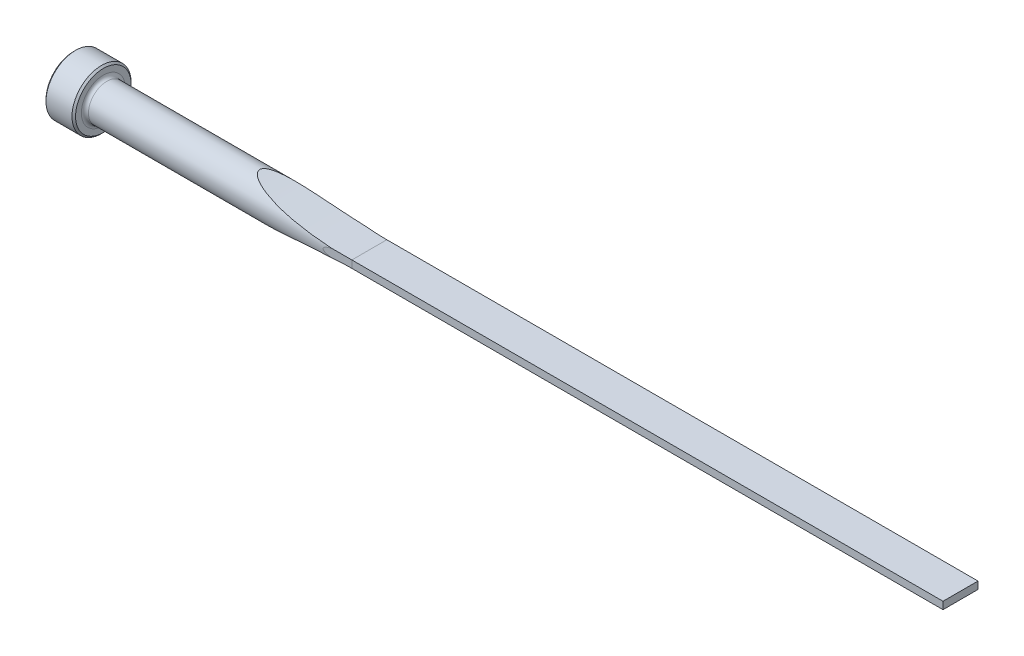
ISO-10303-21;
HEADER;
FILE_DESCRIPTION(('STEP AP214'),'2;1');
FILE_NAME('part.step','',(''),(''),'','','');
FILE_SCHEMA(('AUTOMOTIVE_DESIGN { 1 0 10303 214 1 1 1 1 }'));
ENDSEC;
DATA;
#1=APPLICATION_CONTEXT('core data for automotive mechanical design processes');
#2=APPLICATION_PROTOCOL_DEFINITION('international standard','automotive_design',2000,#1);
#3=PRODUCT_CONTEXT('',#1,'mechanical');
#4=PRODUCT('Part','Part','',(#3));
#5=PRODUCT_RELATED_PRODUCT_CATEGORY('part','',(#4));
#6=PRODUCT_DEFINITION_FORMATION('','',#4);
#7=PRODUCT_DEFINITION_CONTEXT('part definition',#1,'design');
#8=PRODUCT_DEFINITION('design','',#6,#7);
#9=PRODUCT_DEFINITION_SHAPE('','',#8);
#10=(LENGTH_UNIT() NAMED_UNIT(*) SI_UNIT(.MILLI.,.METRE.));
#11=(NAMED_UNIT(*) PLANE_ANGLE_UNIT() SI_UNIT($,.RADIAN.));
#12=(NAMED_UNIT(*) SI_UNIT($,.STERADIAN.) SOLID_ANGLE_UNIT());
#13=UNCERTAINTY_MEASURE_WITH_UNIT(LENGTH_MEASURE(1.E-05),#10,'distance_accuracy_value','');
#14=(GEOMETRIC_REPRESENTATION_CONTEXT(3) GLOBAL_UNCERTAINTY_ASSIGNED_CONTEXT((#13)) GLOBAL_UNIT_ASSIGNED_CONTEXT((#10,
#11,#12)) REPRESENTATION_CONTEXT('',''));
#15=CARTESIAN_POINT('',(0.,0.,0.));
#16=DIRECTION('',(0.,0.,1.));
#17=DIRECTION('',(1.,0.,0.));
#18=AXIS2_PLACEMENT_3D('',#15,#16,#17);
#19=CARTESIAN_POINT('',(0.,0.,0.));
#20=DIRECTION('',(-1.,0.,0.));
#21=DIRECTION('',(0.,0.,1.));
#22=AXIS2_PLACEMENT_3D('',#19,#20,#21);
#23=CYLINDRICAL_SURFACE('',#22,3.9624);
#24=CARTESIAN_POINT('',(7.112,0.,0.));
#25=DIRECTION('',(-1.,0.,0.));
#26=DIRECTION('',(0.,0.,1.));
#27=AXIS2_PLACEMENT_3D('',#24,#25,#26);
#28=CIRCLE('',#27,3.9624);
#29=CARTESIAN_POINT('',(7.112,0.,3.9624));
#30=VERTEX_POINT('',#29);
#31=EDGE_CURVE('E153',#30,#30,#28,.F.);
#32=ORIENTED_EDGE('',*,*,#31,.T.);
#33=EDGE_LOOP('',(#32));
#34=FACE_BOUND('',#33,.T.);
#35=CARTESIAN_POINT('',(63.5,1.25260892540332,3.75919999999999));
#36=CARTESIAN_POINT('',(63.2054597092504,1.25248483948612,3.75919752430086));
#37=CARTESIAN_POINT('',(62.9108915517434,1.24820563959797,3.76066368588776));
#38=CARTESIAN_POINT('',(62.3217237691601,1.23049372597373,3.76652069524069));
#39=CARTESIAN_POINT('',(62.0271244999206,1.21705045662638,3.77091491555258));
#40=CARTESIAN_POINT('',(61.4308396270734,1.17967714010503,3.78276967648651));
#41=CARTESIAN_POINT('',(61.1291720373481,1.15547987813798,3.79030802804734));
#42=CARTESIAN_POINT('',(60.5272911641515,1.09440743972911,3.80840647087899));
#43=CARTESIAN_POINT('',(60.2270772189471,1.05753871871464,3.8189650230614));
#44=CARTESIAN_POINT('',(59.7800368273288,0.989457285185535,3.83693978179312));
#45=CARTESIAN_POINT('',(59.6321720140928,0.964761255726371,3.84325719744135));
#46=CARTESIAN_POINT('',(59.3374097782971,0.910045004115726,3.85658413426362));
#47=CARTESIAN_POINT('',(59.1905125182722,0.880023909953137,3.86359376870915));
#48=CARTESIAN_POINT('',(58.8991412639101,0.813153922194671,3.87821506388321));
#49=CARTESIAN_POINT('',(58.7546584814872,0.776342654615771,3.88582328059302));
#50=CARTESIAN_POINT('',(58.4683237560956,0.692871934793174,3.90159372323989));
#51=CARTESIAN_POINT('',(58.326472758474,0.646209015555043,3.90975614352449));
#52=CARTESIAN_POINT('',(58.1184403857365,0.563595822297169,3.92220822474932));
#53=CARTESIAN_POINT('',(58.0497887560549,0.533901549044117,3.92640002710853));
#54=CARTESIAN_POINT('',(57.9154966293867,0.468472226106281,3.93475139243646));
#55=CARTESIAN_POINT('',(57.849847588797,0.432755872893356,3.93891101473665));
#56=CARTESIAN_POINT('',(57.7609652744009,0.375177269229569,3.94463417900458));
#57=CARTESIAN_POINT('',(57.7351949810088,0.357278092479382,3.94630548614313));
#58=CARTESIAN_POINT('',(57.6852094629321,0.319212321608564,3.94956785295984));
#59=CARTESIAN_POINT('',(57.6609996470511,0.299038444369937,3.95115862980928));
#60=CARTESIAN_POINT('',(57.6148081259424,0.255565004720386,3.95421108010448));
#61=CARTESIAN_POINT('',(57.5928654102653,0.232222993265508,3.95567045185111));
#62=CARTESIAN_POINT('',(57.5535366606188,0.181966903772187,3.95829832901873));
#63=CARTESIAN_POINT('',(57.5361215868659,0.155077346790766,3.95946868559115));
#64=CARTESIAN_POINT('',(57.5155791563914,0.111677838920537,3.96085301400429));
#65=CARTESIAN_POINT('',(57.5096295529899,0.0965229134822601,3.9612547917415));
#66=CARTESIAN_POINT('',(57.500234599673,0.0654488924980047,3.96188979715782));
#67=CARTESIAN_POINT('',(57.4967862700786,0.049530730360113,3.96212322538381));
#68=CARTESIAN_POINT('',(57.4927629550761,0.0172237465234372,3.9623956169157));
#69=CARTESIAN_POINT('',(57.4922055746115,0.000832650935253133,3.96243338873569));
#70=CARTESIAN_POINT('',(57.4940837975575,-0.0317780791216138,3.9623061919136));
#71=CARTESIAN_POINT('',(57.4965210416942,-0.047997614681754,3.96214111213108));
#72=CARTESIAN_POINT('',(57.5046347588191,-0.0820379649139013,3.96159228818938));
#73=CARTESIAN_POINT('',(57.5107227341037,-0.0997583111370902,3.96118077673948));
#74=CARTESIAN_POINT('',(57.525684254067,-0.133969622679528,3.96017177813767));
#75=CARTESIAN_POINT('',(57.5345631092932,-0.150458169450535,3.959573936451));
#76=CARTESIAN_POINT('',(57.5604069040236,-0.191779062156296,3.9578387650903));
#77=CARTESIAN_POINT('',(57.5790021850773,-0.215572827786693,3.95659469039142));
#78=CARTESIAN_POINT('',(57.6193795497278,-0.260234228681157,3.9539086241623));
#79=CARTESIAN_POINT('',(57.6411704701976,-0.281093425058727,3.95246608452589));
#80=CARTESIAN_POINT('',(57.6954927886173,-0.328045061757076,3.94889231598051));
#81=CARTESIAN_POINT('',(57.7289333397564,-0.3530676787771,3.94670948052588));
#82=CARTESIAN_POINT('',(57.7980333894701,-0.399868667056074,3.94224113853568));
#83=CARTESIAN_POINT('',(57.8336975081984,-0.421639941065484,3.93995542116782));
#84=CARTESIAN_POINT('',(57.9430970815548,-0.483498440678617,3.93301358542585));
#85=CARTESIAN_POINT('',(58.0189061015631,-0.519877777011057,3.92829485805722));
#86=CARTESIAN_POINT('',(58.1687512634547,-0.584557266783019,3.9191687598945));
#87=CARTESIAN_POINT('',(58.2426498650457,-0.613195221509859,3.91475872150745));
#88=CARTESIAN_POINT('',(58.3919011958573,-0.666460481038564,3.9060427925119));
#89=CARTESIAN_POINT('',(58.4672543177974,-0.691086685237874,3.90173693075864));
#90=CARTESIAN_POINT('',(58.6950368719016,-0.760533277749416,3.88901656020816));
#91=CARTESIAN_POINT('',(58.8488541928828,-0.800789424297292,3.88081976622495));
#92=CARTESIAN_POINT('',(59.1588067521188,-0.873378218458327,3.86512223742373));
#93=CARTESIAN_POINT('',(59.3149477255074,-0.905685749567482,3.85762375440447));
#94=CARTESIAN_POINT('',(59.6281805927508,-0.96419355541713,3.84341555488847));
#95=CARTESIAN_POINT('',(59.7852709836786,-0.990401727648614,3.83670482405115));
#96=CARTESIAN_POINT('',(60.24046590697,-1.05927541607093,3.81847637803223));
#97=CARTESIAN_POINT('',(60.5395356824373,-1.09580537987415,3.80800147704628));
#98=CARTESIAN_POINT('',(61.139246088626,-1.15634236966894,3.79004336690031));
#99=CARTESIAN_POINT('',(61.4398879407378,-1.18033747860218,3.78256300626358));
#100=CARTESIAN_POINT('',(62.0338753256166,-1.21737987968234,3.77080747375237));
#101=CARTESIAN_POINT('',(62.3272025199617,-1.23070106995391,3.76645243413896));
#102=CARTESIAN_POINT('',(62.9136956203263,-1.24824774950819,3.76064980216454));
#103=CARTESIAN_POINT('',(63.2068610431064,-1.25248764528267,3.7591976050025));
#104=CARTESIAN_POINT('',(63.5,-1.25260892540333,3.75919999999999));
#105=B_SPLINE_CURVE_WITH_KNOTS('',3,(#35,#36,#37,#38,#39,#40,#41,#42,#43,#44,#45,#46,#47,#48,
#49,#50,#51,#52,#53,#54,#55,#56,#57,#58,#59,#60,#61,#62,#63,#64,#65,#66,#67,#68,#69,#70,#71,#72,
#73,#74,#75,#76,#77,#78,#79,#80,#81,#82,#83,#84,#85,#86,#87,#88,#89,#90,#91,#92,#93,#94,#95,#96,
#97,#98,#99,#100,#101,#102,#103,#104),.UNSPECIFIED.,.F.,.F.,(4,2,2,2,2,2,2,2,2,2,2,2,2,2,2,2,2,
2,2,2,2,2,2,2,2,2,2,2,2,2,2,2,2,2,4),(0.,0.883632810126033,1.76828515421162,2.67626818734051,
3.58378933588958,4.03386031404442,4.48400506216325,4.93172655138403,5.3796058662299,
5.60421216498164,5.8281335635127,5.92231486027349,6.01680676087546,6.1127198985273,
6.20800177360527,6.2566860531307,6.30531224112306,6.35423420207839,6.40318297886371,
6.45909548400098,6.5151150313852,6.60527273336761,6.69568462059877,6.8208446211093,
6.94627395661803,7.19837774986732,7.43639814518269,7.67448373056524,8.15173410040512,
8.63047368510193,9.10858990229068,10.0125950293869,10.9174580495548,11.7982831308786,
12.67770984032),.UNSPECIFIED.);
#106=CARTESIAN_POINT('',(59.2410589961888,0.88947535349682,3.86127535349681));
#107=VERTEX_POINT('',#106);
#108=CARTESIAN_POINT('',(59.2410589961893,-0.889475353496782,3.86127535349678));
#109=VERTEX_POINT('',#108);
#110=EDGE_CURVE('E156',#107,#109,#105,.T.);
#111=ORIENTED_EDGE('',*,*,#110,.F.);
#112=CARTESIAN_POINT('',(63.5,0.787399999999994,3.88337675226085));
#113=CARTESIAN_POINT('',(63.1693792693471,0.787400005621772,3.8833724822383));
#114=CARTESIAN_POINT('',(62.8387615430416,0.789244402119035,3.88300338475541));
#115=CARTESIAN_POINT('',(62.1775683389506,0.79662159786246,3.88149814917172));
#116=CARTESIAN_POINT('',(61.8469928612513,0.802154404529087,3.88036200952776));
#117=CARTESIAN_POINT('',(60.8553544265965,0.824285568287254,3.87574680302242));
#118=CARTESIAN_POINT('',(60.1944112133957,0.84641666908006,3.87106094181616));
#119=CARTESIAN_POINT('',(58.8730830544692,0.905424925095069,3.85768449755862));
#120=CARTESIAN_POINT('',(58.2126982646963,0.942305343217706,3.84899302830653));
#121=CARTESIAN_POINT('',(56.893021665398,1.03078637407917,3.82625055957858));
#122=CARTESIAN_POINT('',(56.2337298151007,1.0823864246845,3.81219976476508));
#123=CARTESIAN_POINT('',(55.1183981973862,1.18220746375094,3.78216924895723));
#124=CARTESIAN_POINT('',(54.6619630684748,1.22662148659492,3.76809892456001));
#125=CARTESIAN_POINT('',(53.7499856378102,1.32248934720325,3.73553279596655));
#126=CARTESIAN_POINT('',(53.2944433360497,1.37394318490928,3.71703699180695));
#127=CARTESIAN_POINT('',(52.3844435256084,1.48386008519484,3.67454034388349));
#128=CARTESIAN_POINT('',(51.9299860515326,1.54232336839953,3.65053932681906));
#129=CARTESIAN_POINT('',(51.0224388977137,1.66620819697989,3.59568591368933));
#130=CARTESIAN_POINT('',(50.5693491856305,1.73162957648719,3.56483368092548));
#131=CARTESIAN_POINT('',(49.6641937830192,1.86946141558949,3.49452880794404));
#132=CARTESIAN_POINT('',(49.2121306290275,1.94188215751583,3.45506340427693));
#133=CARTESIAN_POINT('',(48.3102314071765,2.09350738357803,3.36535346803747));
#134=CARTESIAN_POINT('',(47.8603952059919,2.17271145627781,3.31510958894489));
#135=CARTESIAN_POINT('',(46.9633080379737,2.33778135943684,3.2008638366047));
#136=CARTESIAN_POINT('',(46.5160591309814,2.42365187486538,3.13685223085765));
#137=CARTESIAN_POINT('',(45.8483923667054,2.55713953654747,3.02736328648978));
#138=CARTESIAN_POINT('',(45.6263945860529,2.60241068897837,2.98862653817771));
#139=CARTESIAN_POINT('',(45.1836897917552,2.69444697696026,2.90592636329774));
#140=CARTESIAN_POINT('',(44.9629827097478,2.74121203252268,2.86196321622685));
#141=CARTESIAN_POINT('',(44.5226484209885,2.83625735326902,2.76780501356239));
#142=CARTESIAN_POINT('',(44.3030250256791,2.88454095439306,2.71759540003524));
#143=CARTESIAN_POINT('',(43.8658149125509,2.98238888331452,2.60984200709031));
#144=CARTESIAN_POINT('',(43.6482285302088,3.03195341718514,2.55229704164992));
#145=CARTESIAN_POINT('',(43.2164200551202,3.1320109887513,2.42846573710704));
#146=CARTESIAN_POINT('',(43.0021904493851,3.18250114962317,2.36220348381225));
#147=CARTESIAN_POINT('',(42.5776644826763,3.28419729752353,2.21865519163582));
#148=CARTESIAN_POINT('',(42.3673664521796,3.33540296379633,2.14137395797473));
#149=CARTESIAN_POINT('',(41.9913165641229,3.42839026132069,1.98826340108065));
#150=CARTESIAN_POINT('',(41.8245782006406,3.47014650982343,1.91485673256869));
#151=CARTESIAN_POINT('',(41.4961653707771,3.55337685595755,1.75564392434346));
#152=CARTESIAN_POINT('',(41.3345093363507,3.59484957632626,1.66979784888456));
#153=CARTESIAN_POINT('',(41.0980542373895,3.65618699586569,1.52825559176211));
#154=CARTESIAN_POINT('',(41.0197845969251,3.67660870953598,1.47860504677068));
#155=CARTESIAN_POINT('',(40.866451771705,3.71683087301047,1.37437693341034));
#156=CARTESIAN_POINT('',(40.791387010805,3.73663162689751,1.31980182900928));
#157=CARTESIAN_POINT('',(40.6459337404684,3.77519312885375,1.20506330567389));
#158=CARTESIAN_POINT('',(40.5755245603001,3.79395840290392,1.14492789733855));
#159=CARTESIAN_POINT('',(40.4408444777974,3.83001719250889,1.01781369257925));
#160=CARTESIAN_POINT('',(40.3765637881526,3.84731304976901,0.950846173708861));
#161=CARTESIAN_POINT('',(40.2702529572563,3.87603024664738,0.824736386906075));
#162=CARTESIAN_POINT('',(40.226462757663,3.88790000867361,0.767197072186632));
#163=CARTESIAN_POINT('',(40.1461270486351,3.90973187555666,0.646801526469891));
#164=CARTESIAN_POINT('',(40.109583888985,3.91969336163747,0.583943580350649));
#165=CARTESIAN_POINT('',(40.0459164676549,3.9370817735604,0.452174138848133));
#166=CARTESIAN_POINT('',(40.0189160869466,3.94447534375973,0.383196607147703));
#167=CARTESIAN_POINT('',(39.9780102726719,3.95568784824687,0.241204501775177));
#168=CARTESIAN_POINT('',(39.9640756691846,3.95951474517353,0.168199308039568));
#169=CARTESIAN_POINT('',(39.9518620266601,3.9628688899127,0.0276036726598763));
#170=CARTESIAN_POINT('',(39.9522506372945,3.962762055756,-0.0398608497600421));
#171=CARTESIAN_POINT('',(39.9653488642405,3.95916522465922,-0.173500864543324));
#172=CARTESIAN_POINT('',(39.9780681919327,3.95567256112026,-0.239675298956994));
#173=CARTESIAN_POINT('',(40.0165826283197,3.94511439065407,-0.376839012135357));
#174=CARTESIAN_POINT('',(40.0438257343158,3.93765350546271,-0.447381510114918));
#175=CARTESIAN_POINT('',(40.1089002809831,3.91987937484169,-0.582973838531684));
#176=CARTESIAN_POINT('',(40.146750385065,3.90956110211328,-0.64801372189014));
#177=CARTESIAN_POINT('',(40.2560500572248,3.87986173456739,-0.811067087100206));
#178=CARTESIAN_POINT('',(40.3337788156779,3.85882884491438,-0.904512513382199));
#179=CARTESIAN_POINT('',(40.5013669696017,3.8137689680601,-1.07884269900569));
#180=CARTESIAN_POINT('',(40.5912602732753,3.789733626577,-1.1596909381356));
#181=CARTESIAN_POINT('',(40.8088802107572,3.73194955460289,-1.33578715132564));
#182=CARTESIAN_POINT('',(40.9394534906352,3.69756955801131,-1.42726069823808));
#183=CARTESIAN_POINT('',(41.2085826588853,3.62740818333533,-1.59716585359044));
#184=CARTESIAN_POINT('',(41.3471538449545,3.5916241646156,-1.6755712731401));
#185=CARTESIAN_POINT('',(41.6301031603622,3.51931398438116,-1.82257305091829));
#186=CARTESIAN_POINT('',(41.774507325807,3.48278496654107,-1.89111728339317));
#187=CARTESIAN_POINT('',(42.0667172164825,3.40966781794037,-2.01996308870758));
#188=CARTESIAN_POINT('',(42.2145196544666,3.37307977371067,-2.08027226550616));
#189=CARTESIAN_POINT('',(42.4916680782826,3.3052410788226,-2.18617581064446));
#190=CARTESIAN_POINT('',(42.6206766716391,3.27396553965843,-2.23264583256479));
#191=CARTESIAN_POINT('',(42.8802039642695,3.2116702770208,-2.32136153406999));
#192=CARTESIAN_POINT('',(43.0107227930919,3.18065057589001,-2.36360684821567));
#193=CARTESIAN_POINT('',(43.4042032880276,3.0880839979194,-2.48490417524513));
#194=CARTESIAN_POINT('',(43.6689796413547,3.02705643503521,-2.55847704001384));
#195=CARTESIAN_POINT('',(44.2023238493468,2.90673022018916,-2.69439177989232));
#196=CARTESIAN_POINT('',(44.4708983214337,2.84743533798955,-2.75671050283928));
#197=CARTESIAN_POINT('',(45.0104857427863,2.73095083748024,-2.87214930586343));
#198=CARTESIAN_POINT('',(45.2814989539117,2.67376144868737,-2.92526838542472));
#199=CARTESIAN_POINT('',(45.8258098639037,2.5615693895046,-3.02399762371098));
#200=CARTESIAN_POINT('',(46.0991106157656,2.50657051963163,-3.06959512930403));
#201=CARTESIAN_POINT('',(46.6471765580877,2.3989681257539,-3.15440243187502));
#202=CARTESIAN_POINT('',(46.9219418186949,2.34636471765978,-3.19361191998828));
#203=CARTESIAN_POINT('',(47.472304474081,2.24369674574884,-3.26655764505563));
#204=CARTESIAN_POINT('',(47.7479004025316,2.19362909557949,-3.30030065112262));
#205=CARTESIAN_POINT('',(48.3000682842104,2.09601517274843,-3.36313743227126));
#206=CARTESIAN_POINT('',(48.5766402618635,2.04846896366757,-3.3922310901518));
#207=CARTESIAN_POINT('',(49.4252873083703,1.90671704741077,-3.47524875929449));
#208=CARTESIAN_POINT('',(49.998704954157,1.8166863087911,-3.52265966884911));
#209=CARTESIAN_POINT('',(51.1481008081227,1.64776053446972,-3.60475663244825));
#210=CARTESIAN_POINT('',(51.724079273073,1.56886664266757,-3.63944137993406));
#211=CARTESIAN_POINT('',(52.8783861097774,1.42228773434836,-3.69918591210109));
#212=CARTESIAN_POINT('',(53.4567159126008,1.3546111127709,-3.72423850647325));
#213=CARTESIAN_POINT('',(54.6148293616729,1.23061452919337,-3.76702730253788));
#214=CARTESIAN_POINT('',(55.1946129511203,1.17429413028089,-3.78476378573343));
#215=CARTESIAN_POINT('',(56.3540454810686,1.07316172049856,-3.81467022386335));
#216=CARTESIAN_POINT('',(56.9336919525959,1.02832485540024,-3.82685224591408));
#217=CARTESIAN_POINT('',(58.0938331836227,0.950026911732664,-3.84703720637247));
#218=CARTESIAN_POINT('',(58.6743279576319,0.916566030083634,-3.85504007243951));
#219=CARTESIAN_POINT('',(59.8356796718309,0.861049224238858,-3.86781814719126));
#220=CARTESIAN_POINT('',(60.4165363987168,0.838989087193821,-3.872594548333));
#221=CARTESIAN_POINT('',(61.5785695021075,0.80626628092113,-3.87953998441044));
#222=CARTESIAN_POINT('',(62.1597458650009,0.795603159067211,-3.8817091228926));
#223=CARTESIAN_POINT('',(62.8674659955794,0.789560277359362,-3.88293796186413));
#224=CARTESIAN_POINT('',(62.99397377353,0.788750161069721,-3.88310266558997));
#225=CARTESIAN_POINT('',(63.2469874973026,0.787670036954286,-3.88332214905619));
#226=CARTESIAN_POINT('',(63.3734934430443,0.787400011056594,-3.88337693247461));
#227=CARTESIAN_POINT('',(63.5,0.787399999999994,-3.88337675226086));
#228=B_SPLINE_CURVE_WITH_KNOTS('',3,(#112,#113,#114,#115,#116,#117,#118,#119,#120,#121,#122,
#123,#124,#125,#126,#127,#128,#129,#130,#131,#132,#133,#134,#135,#136,#137,#138,#139,#140,#141,
#142,#143,#144,#145,#146,#147,#148,#149,#150,#151,#152,#153,#154,#155,#156,#157,#158,#159,#160,
#161,#162,#163,#164,#165,#166,#167,#168,#169,#170,#171,#172,#173,#174,#175,#176,#177,#178,#179,
#180,#181,#182,#183,#184,#185,#186,#187,#188,#189,#190,#191,#192,#193,#194,#195,#196,#197,#198,
#199,#200,#201,#202,#203,#204,#205,#206,#207,#208,#209,#210,#211,#212,#213,#214,#215,#216,#217,
#218,#219,#220,#221,#222,#223,#224,#225,#226,#227),.UNSPECIFIED.,.F.,.F.,(4,2,2,2,2,2,2,2,2,2,2,
2,2,2,2,2,2,2,2,2,2,2,2,2,2,2,2,2,2,2,2,2,2,2,2,2,2,2,2,2,2,2,2,2,2,2,2,2,2,2,2,2,2,2,2,2,2,4),
(0.,0.991850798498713,1.98370359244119,3.96750439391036,5.95174430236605,7.93590844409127,
9.3122618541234,10.6886152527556,12.0650119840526,13.4413759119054,14.8197934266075,
16.1981273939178,17.5774389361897,18.2669484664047,18.9564211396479,19.6475318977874,
20.3387545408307,21.0281059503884,21.7171576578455,22.2775648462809,22.8398127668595,
23.1244115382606,23.4088686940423,23.6919637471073,23.9745988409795,24.1939791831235,
24.413430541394,24.6356342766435,24.8573407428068,25.0584810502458,25.2597798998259,
25.4864909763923,25.7136034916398,26.0815750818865,26.4505943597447,26.9387163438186,
27.4278050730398,27.9193909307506,28.4105197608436,28.8323721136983,29.254260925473,
30.0983968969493,30.9442501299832,31.7901952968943,32.6375493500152,33.4849443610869,
34.3312818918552,35.177640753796,36.9244292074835,38.6713969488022,40.4196662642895,
42.1678683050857,43.9122540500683,45.6566699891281,47.4004408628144,49.1441424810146,
49.5236733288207,49.9031914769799),.UNSPECIFIED.);
#229=CARTESIAN_POINT('',(59.241058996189,0.889475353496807,-3.86127535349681));
#230=VERTEX_POINT('',#229);
#231=EDGE_CURVE('E106',#107,#230,#228,.T.);
#232=ORIENTED_EDGE('',*,*,#231,.T.);
#233=CARTESIAN_POINT('',(63.5,1.25260892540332,-3.75919999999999));
#234=CARTESIAN_POINT('',(63.2054597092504,1.25248483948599,-3.7591975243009));
#235=CARTESIAN_POINT('',(62.9108915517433,1.24820563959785,-3.7606636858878));
#236=CARTESIAN_POINT('',(62.3217237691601,1.23049372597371,-3.76652069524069));
#237=CARTESIAN_POINT('',(62.0271244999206,1.21705045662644,-3.77091491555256));
#238=CARTESIAN_POINT('',(61.4308396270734,1.17967714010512,-3.78276967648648));
#239=CARTESIAN_POINT('',(61.1291720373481,1.15547987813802,-3.79030802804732));
#240=CARTESIAN_POINT('',(60.5272911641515,1.09440743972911,-3.80840647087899));
#241=CARTESIAN_POINT('',(60.2270772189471,1.05753871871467,-3.8189650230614));
#242=CARTESIAN_POINT('',(59.7800368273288,0.989457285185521,-3.83693978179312));
#243=CARTESIAN_POINT('',(59.6321720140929,0.964761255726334,-3.84325719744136));
#244=CARTESIAN_POINT('',(59.3374097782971,0.910045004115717,-3.85658413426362));
#245=CARTESIAN_POINT('',(59.1905125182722,0.880023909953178,-3.86359376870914));
#246=CARTESIAN_POINT('',(58.8991412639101,0.813153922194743,-3.87821506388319));
#247=CARTESIAN_POINT('',(58.7546584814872,0.776342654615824,-3.88582328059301));
#248=CARTESIAN_POINT('',(58.4683237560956,0.6928719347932,-3.90159372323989));
#249=CARTESIAN_POINT('',(58.326472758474,0.646209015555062,-3.90975614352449));
#250=CARTESIAN_POINT('',(58.1184403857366,0.563595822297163,-3.92220822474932));
#251=CARTESIAN_POINT('',(58.0497887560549,0.533901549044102,-3.92640002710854));
#252=CARTESIAN_POINT('',(57.9154966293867,0.468472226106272,-3.93475139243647));
#253=CARTESIAN_POINT('',(57.849847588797,0.432755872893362,-3.93891101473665));
#254=CARTESIAN_POINT('',(57.7609652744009,0.375177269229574,-3.94463417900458));
#255=CARTESIAN_POINT('',(57.7351949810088,0.357278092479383,-3.94630548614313));
#256=CARTESIAN_POINT('',(57.6852094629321,0.31921232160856,-3.94956785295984));
#257=CARTESIAN_POINT('',(57.6609996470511,0.299038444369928,-3.95115862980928));
#258=CARTESIAN_POINT('',(57.6148081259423,0.255565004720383,-3.95421108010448));
#259=CARTESIAN_POINT('',(57.5928654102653,0.232222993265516,-3.9556704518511));
#260=CARTESIAN_POINT('',(57.5535366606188,0.181966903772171,-3.95829832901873));
#261=CARTESIAN_POINT('',(57.536121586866,0.155077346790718,-3.95946868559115));
#262=CARTESIAN_POINT('',(57.5155791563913,0.111677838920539,-3.96085301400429));
#263=CARTESIAN_POINT('',(57.5096295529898,0.0965229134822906,-3.9612547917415));
#264=CARTESIAN_POINT('',(57.5002345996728,0.065448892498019,-3.96188979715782));
#265=CARTESIAN_POINT('',(57.4967862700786,0.0495307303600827,-3.96212322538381));
#266=CARTESIAN_POINT('',(57.4927629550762,0.0172237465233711,-3.9623956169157));
#267=CARTESIAN_POINT('',(57.4922055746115,0.000832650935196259,-3.96243338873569));
#268=CARTESIAN_POINT('',(57.4940837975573,-0.0317780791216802,-3.9623061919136));
#269=CARTESIAN_POINT('',(57.496521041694,-0.0479976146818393,-3.96214111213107));
#270=CARTESIAN_POINT('',(57.504634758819,-0.0820379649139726,-3.96159228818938));
#271=CARTESIAN_POINT('',(57.5107227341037,-0.0997583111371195,-3.96118077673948));
#272=CARTESIAN_POINT('',(57.525684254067,-0.133969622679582,-3.96017177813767));
#273=CARTESIAN_POINT('',(57.5345631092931,-0.150458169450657,-3.95957393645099));
#274=CARTESIAN_POINT('',(57.5604069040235,-0.191779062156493,-3.95783876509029));
#275=CARTESIAN_POINT('',(57.5790021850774,-0.215572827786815,-3.95659469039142));
#276=CARTESIAN_POINT('',(57.6193795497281,-0.260234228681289,-3.95390862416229));
#277=CARTESIAN_POINT('',(57.6411704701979,-0.281093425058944,-3.95246608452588));
#278=CARTESIAN_POINT('',(57.6954927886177,-0.328045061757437,-3.94889231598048));
#279=CARTESIAN_POINT('',(57.7289333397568,-0.353067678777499,-3.94670948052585));
#280=CARTESIAN_POINT('',(57.7980333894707,-0.39986866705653,-3.94224113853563));
#281=CARTESIAN_POINT('',(57.8336975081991,-0.421639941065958,-3.93995542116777));
#282=CARTESIAN_POINT('',(57.9430970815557,-0.483498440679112,-3.93301358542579));
#283=CARTESIAN_POINT('',(58.0189061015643,-0.51987777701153,-3.92829485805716));
#284=CARTESIAN_POINT('',(58.1687512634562,-0.584557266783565,-3.91916875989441));
#285=CARTESIAN_POINT('',(58.2426498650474,-0.61319522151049,-3.91475872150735));
#286=CARTESIAN_POINT('',(58.3919011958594,-0.666460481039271,-3.90604279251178));
#287=CARTESIAN_POINT('',(58.4672543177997,-0.69108668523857,-3.90173693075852));
#288=CARTESIAN_POINT('',(58.6950368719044,-0.760533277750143,-3.88901656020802));
#289=CARTESIAN_POINT('',(58.848854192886,-0.800789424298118,-3.88081976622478));
#290=CARTESIAN_POINT('',(59.1588067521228,-0.873378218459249,-3.86512223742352));
#291=CARTESIAN_POINT('',(59.3149477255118,-0.9056857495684,-3.85762375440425));
#292=CARTESIAN_POINT('',(59.6281805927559,-0.964193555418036,-3.84341555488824));
#293=CARTESIAN_POINT('',(59.7852709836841,-0.99040172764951,-3.83670482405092));
#294=CARTESIAN_POINT('',(60.2404659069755,-1.05927541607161,-3.81847637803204));
#295=CARTESIAN_POINT('',(60.5395356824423,-1.09580537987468,-3.80800147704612));
#296=CARTESIAN_POINT('',(61.13924608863,-1.15634236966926,-3.79004336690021));
#297=CARTESIAN_POINT('',(61.4398879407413,-1.18033747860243,-3.7825630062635));
#298=CARTESIAN_POINT('',(62.0338753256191,-1.21737987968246,-3.77080747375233));
#299=CARTESIAN_POINT('',(62.3272025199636,-1.23070106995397,-3.76645243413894));
#300=CARTESIAN_POINT('',(62.9136956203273,-1.24824774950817,-3.76064980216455));
#301=CARTESIAN_POINT('',(63.2068610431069,-1.25248764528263,-3.75919760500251));
#302=CARTESIAN_POINT('',(63.5,-1.25260892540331,-3.75919999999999));
#303=B_SPLINE_CURVE_WITH_KNOTS('',3,(#233,#234,#235,#236,#237,#238,#239,#240,#241,#242,#243,
#244,#245,#246,#247,#248,#249,#250,#251,#252,#253,#254,#255,#256,#257,#258,#259,#260,#261,#262,
#263,#264,#265,#266,#267,#268,#269,#270,#271,#272,#273,#274,#275,#276,#277,#278,#279,#280,#281,
#282,#283,#284,#285,#286,#287,#288,#289,#290,#291,#292,#293,#294,#295,#296,#297,#298,#299,#300,
#301,#302),.UNSPECIFIED.,.F.,.F.,(4,2,2,2,2,2,2,2,2,2,2,2,2,2,2,2,2,2,2,2,2,2,2,2,2,2,2,2,2,2,2,
2,2,2,4),(0.,0.883632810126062,1.76828515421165,2.67626818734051,3.58378933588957,
4.03386031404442,4.48400506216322,4.93172655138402,5.37960586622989,5.60421216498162,
5.82813356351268,5.92231486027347,6.01680676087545,6.11271989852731,6.20800177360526,
6.25668605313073,6.30531224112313,6.35423420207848,6.40318297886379,6.45909548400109,
6.51511503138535,6.60527273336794,6.69568462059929,6.82084462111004,6.94627395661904,
7.19837774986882,7.43639814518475,7.67448373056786,8.15173410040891,8.63047368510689,
9.1085899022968,10.0125950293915,10.9174580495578,11.7982831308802,12.6777098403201),.UNSPECIFIED.);
#304=CARTESIAN_POINT('',(59.2410589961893,-0.889475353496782,-3.86127535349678));
#305=VERTEX_POINT('',#304);
#306=EDGE_CURVE('E175',#230,#305,#303,.T.);
#307=ORIENTED_EDGE('',*,*,#306,.T.);
#308=CARTESIAN_POINT('',(63.5,-0.787399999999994,3.88337675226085));
#309=CARTESIAN_POINT('',(63.1693792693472,-0.787400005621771,3.8833724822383));
#310=CARTESIAN_POINT('',(62.8387615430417,-0.789244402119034,3.88300338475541));
#311=CARTESIAN_POINT('',(62.1775683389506,-0.796621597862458,3.88149814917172));
#312=CARTESIAN_POINT('',(61.8469928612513,-0.802154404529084,3.88036200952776));
#313=CARTESIAN_POINT('',(60.8553544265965,-0.824285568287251,3.87574680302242));
#314=CARTESIAN_POINT('',(60.1944112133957,-0.846416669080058,3.87106094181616));
#315=CARTESIAN_POINT('',(58.8730830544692,-0.905424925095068,3.85768449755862));
#316=CARTESIAN_POINT('',(58.2126982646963,-0.942305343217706,3.84899302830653));
#317=CARTESIAN_POINT('',(56.893021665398,-1.03078637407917,3.82625055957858));
#318=CARTESIAN_POINT('',(56.2337298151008,-1.0823864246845,3.81219976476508));
#319=CARTESIAN_POINT('',(55.1183981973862,-1.18220746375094,3.78216924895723));
#320=CARTESIAN_POINT('',(54.6619630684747,-1.22662148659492,3.76809892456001));
#321=CARTESIAN_POINT('',(53.7499856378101,-1.32248934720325,3.73553279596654));
#322=CARTESIAN_POINT('',(53.2944433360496,-1.37394318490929,3.71703699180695));
#323=CARTESIAN_POINT('',(52.3844435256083,-1.48386008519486,3.67454034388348));
#324=CARTESIAN_POINT('',(51.9299860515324,-1.54232336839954,3.65053932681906));
#325=CARTESIAN_POINT('',(51.0224388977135,-1.66620819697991,3.59568591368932));
#326=CARTESIAN_POINT('',(50.5693491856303,-1.73162957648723,3.56483368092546));
#327=CARTESIAN_POINT('',(49.6641937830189,-1.86946141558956,3.494528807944));
#328=CARTESIAN_POINT('',(49.2121306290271,-1.9418821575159,3.45506340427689));
#329=CARTESIAN_POINT('',(48.3102314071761,-2.0935073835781,3.36535346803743));
#330=CARTESIAN_POINT('',(47.8603952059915,-2.17271145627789,3.31510958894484));
#331=CARTESIAN_POINT('',(46.9633080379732,-2.33778135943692,3.20086383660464));
#332=CARTESIAN_POINT('',(46.5160591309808,-2.42365187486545,3.1368522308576));
#333=CARTESIAN_POINT('',(45.8483923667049,-2.55713953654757,3.0273632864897));
#334=CARTESIAN_POINT('',(45.6263945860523,-2.60241068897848,2.98862653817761));
#335=CARTESIAN_POINT('',(45.1836897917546,-2.69444697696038,2.90592636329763));
#336=CARTESIAN_POINT('',(44.9629827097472,-2.7412120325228,2.86196321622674));
#337=CARTESIAN_POINT('',(44.5226484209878,-2.83625735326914,2.76780501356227));
#338=CARTESIAN_POINT('',(44.3030250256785,-2.88454095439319,2.71759540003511));
#339=CARTESIAN_POINT('',(43.8658149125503,-2.98238888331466,2.60984200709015));
#340=CARTESIAN_POINT('',(43.6482285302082,-3.03195341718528,2.55229704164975));
#341=CARTESIAN_POINT('',(43.2164200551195,-3.13201098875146,2.42846573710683));
#342=CARTESIAN_POINT('',(43.0021904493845,-3.18250114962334,2.36220348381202));
#343=CARTESIAN_POINT('',(42.5776644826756,-3.28419729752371,2.21865519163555));
#344=CARTESIAN_POINT('',(42.3673664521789,-3.33540296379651,2.14137395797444));
#345=CARTESIAN_POINT('',(41.9913165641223,-3.42839026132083,1.9882634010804));
#346=CARTESIAN_POINT('',(41.8245782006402,-3.47014650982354,1.9148567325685));
#347=CARTESIAN_POINT('',(41.4961653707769,-3.55337685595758,1.75564392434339));
#348=CARTESIAN_POINT('',(41.3345093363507,-3.59484957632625,1.66979784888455));
#349=CARTESIAN_POINT('',(41.0980542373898,-3.65618699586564,1.52825559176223));
#350=CARTESIAN_POINT('',(41.0197845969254,-3.67660870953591,1.47860504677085));
#351=CARTESIAN_POINT('',(40.8664517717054,-3.71683087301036,1.37437693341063));
#352=CARTESIAN_POINT('',(40.7913870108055,-3.73663162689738,1.31980182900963));
#353=CARTESIAN_POINT('',(40.645933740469,-3.77519312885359,1.20506330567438));
#354=CARTESIAN_POINT('',(40.5755245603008,-3.79395840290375,1.14492789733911));
#355=CARTESIAN_POINT('',(40.4408444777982,-3.8300171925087,1.01781369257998));
#356=CARTESIAN_POINT('',(40.3765637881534,-3.84731304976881,0.950846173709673));
#357=CARTESIAN_POINT('',(40.270252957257,-3.87603024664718,0.824736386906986));
#358=CARTESIAN_POINT('',(40.2264627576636,-3.88790000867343,0.767197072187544));
#359=CARTESIAN_POINT('',(40.1461270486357,-3.90973187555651,0.6468015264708));
#360=CARTESIAN_POINT('',(40.1095838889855,-3.91969336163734,0.583943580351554));
#361=CARTESIAN_POINT('',(40.0459164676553,-3.9370817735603,0.452174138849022));
#362=CARTESIAN_POINT('',(40.0189160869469,-3.94447534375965,0.383196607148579));
#363=CARTESIAN_POINT('',(39.9780102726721,-3.95568784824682,0.241204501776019));
#364=CARTESIAN_POINT('',(39.9640756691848,-3.95951474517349,0.16819930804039));
#365=CARTESIAN_POINT('',(39.9518620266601,-3.9628688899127,0.0276036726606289));
#366=CARTESIAN_POINT('',(39.9522506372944,-3.96276205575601,-0.0398608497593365));
#367=CARTESIAN_POINT('',(39.9653488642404,-3.95916522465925,-0.173500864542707));
#368=CARTESIAN_POINT('',(39.9780681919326,-3.95567256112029,-0.239675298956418));
#369=CARTESIAN_POINT('',(40.0165826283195,-3.94511439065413,-0.376839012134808));
#370=CARTESIAN_POINT('',(40.0438257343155,-3.93765350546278,-0.447381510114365));
#371=CARTESIAN_POINT('',(40.1089002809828,-3.91987937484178,-0.582973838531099));
#372=CARTESIAN_POINT('',(40.1467503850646,-3.90956110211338,-0.648013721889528));
#373=CARTESIAN_POINT('',(40.2560500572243,-3.87986173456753,-0.811067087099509));
#374=CARTESIAN_POINT('',(40.3337788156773,-3.85882884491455,-0.904512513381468));
#375=CARTESIAN_POINT('',(40.5013669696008,-3.81376896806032,-1.07884269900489));
#376=CARTESIAN_POINT('',(40.5912602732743,-3.78973362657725,-1.15969093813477));
#377=CARTESIAN_POINT('',(40.8088802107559,-3.73194955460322,-1.33578715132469));
#378=CARTESIAN_POINT('',(40.9394534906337,-3.69756955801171,-1.42726069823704));
#379=CARTESIAN_POINT('',(41.2085826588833,-3.62740818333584,-1.59716585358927));
#380=CARTESIAN_POINT('',(41.3471538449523,-3.59162416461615,-1.6755712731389));
#381=CARTESIAN_POINT('',(41.6301031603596,-3.51931398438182,-1.82257305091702));
#382=CARTESIAN_POINT('',(41.7745073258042,-3.48278496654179,-1.89111728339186));
#383=CARTESIAN_POINT('',(42.0667172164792,-3.40966781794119,-2.01996308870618));
#384=CARTESIAN_POINT('',(42.2145196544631,-3.37307977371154,-2.08027226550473));
#385=CARTESIAN_POINT('',(42.4916680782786,-3.30524107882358,-2.18617581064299));
#386=CARTESIAN_POINT('',(42.6206766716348,-3.27396553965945,-2.23264583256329));
#387=CARTESIAN_POINT('',(42.8802039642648,-3.21167027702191,-2.32136153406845));
#388=CARTESIAN_POINT('',(43.010722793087,-3.18065057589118,-2.36360684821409));
#389=CARTESIAN_POINT('',(43.4042032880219,-3.08808399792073,-2.48490417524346));
#390=CARTESIAN_POINT('',(43.6689796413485,-3.02705643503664,-2.55847704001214));
#391=CARTESIAN_POINT('',(44.2023238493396,-2.90673022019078,-2.69439177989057));
#392=CARTESIAN_POINT('',(44.470898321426,-2.84743533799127,-2.75671050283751));
#393=CARTESIAN_POINT('',(45.0104857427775,-2.73095083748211,-2.87214930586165));
#394=CARTESIAN_POINT('',(45.2814989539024,-2.6737614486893,-2.92526838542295));
#395=CARTESIAN_POINT('',(45.8258098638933,-2.56156938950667,-3.02399762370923));
#396=CARTESIAN_POINT('',(46.0991106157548,-2.50657051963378,-3.06959512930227));
#397=CARTESIAN_POINT('',(46.6471765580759,-2.39896812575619,-3.15440243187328));
#398=CARTESIAN_POINT('',(46.9219418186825,-2.34636471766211,-3.19361191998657));
#399=CARTESIAN_POINT('',(47.4723044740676,-2.24369674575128,-3.26655764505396));
#400=CARTESIAN_POINT('',(47.7479004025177,-2.19362909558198,-3.30030065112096));
#401=CARTESIAN_POINT('',(48.3000682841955,-2.09601517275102,-3.36313743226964));
#402=CARTESIAN_POINT('',(48.5766402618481,-2.04846896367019,-3.39223109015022));
#403=CARTESIAN_POINT('',(49.4252873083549,-1.90671704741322,-3.47524875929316));
#404=CARTESIAN_POINT('',(49.9987049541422,-1.81668630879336,-3.52265966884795));
#405=CARTESIAN_POINT('',(51.148100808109,-1.64776053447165,-3.60475663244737));
#406=CARTESIAN_POINT('',(51.7240792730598,-1.56886664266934,-3.6394413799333));
#407=CARTESIAN_POINT('',(52.8783861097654,-1.42228773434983,-3.69918591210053));
#408=CARTESIAN_POINT('',(53.4567159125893,-1.35461111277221,-3.72423850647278));
#409=CARTESIAN_POINT('',(54.6148293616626,-1.23061452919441,-3.76702730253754));
#410=CARTESIAN_POINT('',(55.1946129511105,-1.17429413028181,-3.78476378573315));
#411=CARTESIAN_POINT('',(56.35404548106,-1.07316172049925,-3.81467022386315));
#412=CARTESIAN_POINT('',(56.9336919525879,-1.02832485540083,-3.82685224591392));
#413=CARTESIAN_POINT('',(58.0938331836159,-0.950026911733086,-3.84703720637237));
#414=CARTESIAN_POINT('',(58.6743279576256,-0.916566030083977,-3.85504007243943));
#415=CARTESIAN_POINT('',(59.8356796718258,-0.861049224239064,-3.86781814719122));
#416=CARTESIAN_POINT('',(60.4165363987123,-0.838989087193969,-3.87259454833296));
#417=CARTESIAN_POINT('',(61.5785695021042,-0.806266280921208,-3.87953998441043));
#418=CARTESIAN_POINT('',(62.1597458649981,-0.795603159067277,-3.88170912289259));
#419=CARTESIAN_POINT('',(62.8674659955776,-0.789560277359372,-3.88293796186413));
#420=CARTESIAN_POINT('',(62.9939737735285,-0.788750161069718,-3.88310266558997));
#421=CARTESIAN_POINT('',(63.2469874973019,-0.787670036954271,-3.88332214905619));
#422=CARTESIAN_POINT('',(63.3734934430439,-0.787400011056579,-3.88337693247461));
#423=CARTESIAN_POINT('',(63.5,-0.787399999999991,-3.88337675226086));
#424=B_SPLINE_CURVE_WITH_KNOTS('',3,(#308,#309,#310,#311,#312,#313,#314,#315,#316,#317,#318,
#319,#320,#321,#322,#323,#324,#325,#326,#327,#328,#329,#330,#331,#332,#333,#334,#335,#336,#337,
#338,#339,#340,#341,#342,#343,#344,#345,#346,#347,#348,#349,#350,#351,#352,#353,#354,#355,#356,
#357,#358,#359,#360,#361,#362,#363,#364,#365,#366,#367,#368,#369,#370,#371,#372,#373,#374,#375,
#376,#377,#378,#379,#380,#381,#382,#383,#384,#385,#386,#387,#388,#389,#390,#391,#392,#393,#394,
#395,#396,#397,#398,#399,#400,#401,#402,#403,#404,#405,#406,#407,#408,#409,#410,#411,#412,#413,
#414,#415,#416,#417,#418,#419,#420,#421,#422,#423),.UNSPECIFIED.,.F.,.F.,(4,2,2,2,2,2,2,2,2,2,2,
2,2,2,2,2,2,2,2,2,2,2,2,2,2,2,2,2,2,2,2,2,2,2,2,2,2,2,2,2,2,2,2,2,2,2,2,2,2,2,2,2,2,2,2,2,2,4),
(0.,0.991850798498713,1.98370359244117,3.96750439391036,5.95174430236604,7.93590844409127,
9.31226185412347,10.6886152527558,12.0650119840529,13.4413759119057,14.8197934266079,
16.1981273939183,17.5774389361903,18.2669484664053,18.9564211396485,19.6475318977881,
20.3387545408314,21.0281059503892,21.7171576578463,22.2775648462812,22.8398127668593,
23.1244115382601,23.4088686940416,23.6919637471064,23.9745988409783,24.1939791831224,
24.413430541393,24.6356342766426,24.857340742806,25.0584810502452,25.2597798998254,
25.4864909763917,25.713603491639,26.0815750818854,26.4505943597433,26.9387163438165,
27.4278050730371,27.9193909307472,28.4105197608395,28.8323721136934,29.2542609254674,
30.0983968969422,30.9442501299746,31.7901952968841,32.6375493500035,33.4849443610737,
34.3312818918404,35.1776407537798,36.924429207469,38.6713969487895,40.4196662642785,
42.1678683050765,43.9122540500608,45.6566699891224,47.4004408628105,49.1441424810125,
49.5236733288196,49.9031914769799),.UNSPECIFIED.);
#425=EDGE_CURVE('E105',#109,#305,#424,.T.);
#426=ORIENTED_EDGE('',*,*,#425,.F.);
#427=EDGE_LOOP('',(#111,#232,#307,#426));
#428=FACE_BOUND('',#427,.T.);
#429=ADVANCED_FACE('F33',(#34,#428),#23,.T.);
#430=CARTESIAN_POINT('',(190.5,3.9624,0.));
#431=DIRECTION('',(-1.,0.,0.));
#432=DIRECTION('',(0.,0.,1.));
#433=AXIS2_PLACEMENT_3D('',#430,#431,#432);
#434=PLANE('',#433);
#435=DIRECTION('',(0.,1.,0.));
#436=VECTOR('',#435,1.);
#437=CARTESIAN_POINT('',(190.5,-6.35,3.7592));
#438=LINE('',#437,#436);
#439=CARTESIAN_POINT('',(190.5,-0.787400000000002,3.7592));
#440=VERTEX_POINT('',#439);
#441=CARTESIAN_POINT('',(190.5,0.787400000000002,3.7592));
#442=VERTEX_POINT('',#441);
#443=EDGE_CURVE('E87',#440,#442,#438,.T.);
#444=ORIENTED_EDGE('',*,*,#443,.F.);
#445=DIRECTION('',(0.,0.,1.));
#446=VECTOR('',#445,1.);
#447=CARTESIAN_POINT('',(190.5,-0.787400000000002,0.));
#448=LINE('',#447,#446);
#449=CARTESIAN_POINT('',(190.5,-0.787400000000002,-3.7592));
#450=VERTEX_POINT('',#449);
#451=EDGE_CURVE('E100',#450,#440,#448,.T.);
#452=ORIENTED_EDGE('',*,*,#451,.F.);
#453=DIRECTION('',(0.,1.,0.));
#454=VECTOR('',#453,1.);
#455=CARTESIAN_POINT('',(190.5,-6.35,-3.7592));
#456=LINE('',#455,#454);
#457=CARTESIAN_POINT('',(190.5,0.787399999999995,-3.7592));
#458=VERTEX_POINT('',#457);
#459=EDGE_CURVE('E56',#450,#458,#456,.T.);
#460=ORIENTED_EDGE('',*,*,#459,.T.);
#461=DIRECTION('',(0.,0.,1.));
#462=VECTOR('',#461,1.);
#463=CARTESIAN_POINT('',(190.5,0.787400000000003,0.));
#464=LINE('',#463,#462);
#465=EDGE_CURVE('E102',#458,#442,#464,.T.);
#466=ORIENTED_EDGE('',*,*,#465,.T.);
#467=EDGE_LOOP('',(#444,#452,#460,#466));
#468=FACE_BOUND('',#467,.T.);
#469=ADVANCED_FACE('F99',(#468),#434,.F.);
#470=CARTESIAN_POINT('',(63.5,89.6874,-6.35));
#471=DIRECTION('',(0.,0.,1.));
#472=DIRECTION('',(1.,0.,0.));
#473=AXIS2_PLACEMENT_3D('',#470,#471,#472);
#474=CYLINDRICAL_SURFACE('',#473,88.9);
#475=CARTESIAN_POINT('',(63.5,89.6874,92.6592));
#476=DIRECTION('',(0.,-0.707106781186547,0.707106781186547));
#477=DIRECTION('',(0.,0.707106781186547,0.707106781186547));
#478=AXIS2_PLACEMENT_3D('',#475,#476,#477);
#479=ELLIPSE('',#478,125.723585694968,88.9);
#480=CARTESIAN_POINT('',(63.5,0.787399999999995,3.75919999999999));
#481=VERTEX_POINT('',#480);
#482=EDGE_CURVE('E162',#481,#107,#479,.F.);
#483=ORIENTED_EDGE('',*,*,#482,.F.);
#484=DIRECTION('',(0.,0.,1.));
#485=VECTOR('',#484,1.);
#486=CARTESIAN_POINT('',(63.5,0.787399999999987,-6.35));
#487=LINE('',#486,#485);
#488=CARTESIAN_POINT('',(63.5,0.787399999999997,-3.75919999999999));
#489=VERTEX_POINT('',#488);
#490=EDGE_CURVE('E170',#489,#481,#487,.T.);
#491=ORIENTED_EDGE('',*,*,#490,.F.);
#492=CARTESIAN_POINT('',(63.5,89.6874,-92.6592));
#493=DIRECTION('',(0.,0.707106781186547,0.707106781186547));
#494=DIRECTION('',(0.,-0.707106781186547,0.707106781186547));
#495=AXIS2_PLACEMENT_3D('',#492,#493,#494);
#496=ELLIPSE('',#495,125.723585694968,88.9);
#497=EDGE_CURVE('E169',#489,#230,#496,.F.);
#498=ORIENTED_EDGE('',*,*,#497,.T.);
#499=ORIENTED_EDGE('',*,*,#231,.F.);
#500=EDGE_LOOP('',(#483,#491,#498,#499));
#501=FACE_BOUND('',#500,.T.);
#502=ADVANCED_FACE('F138',(#501),#474,.F.);
#503=CARTESIAN_POINT('',(190.5,0.787400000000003,-6.35));
#504=DIRECTION('',(0.,-1.,0.));
#505=DIRECTION('',(1.,0.,0.));
#506=AXIS2_PLACEMENT_3D('',#503,#504,#505);
#507=PLANE('',#506);
#508=DIRECTION('',(-1.,0.,0.));
#509=VECTOR('',#508,1.);
#510=CARTESIAN_POINT('',(190.5,0.787400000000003,3.7592));
#511=LINE('',#510,#509);
#512=EDGE_CURVE('E188',#442,#481,#511,.T.);
#513=ORIENTED_EDGE('',*,*,#512,.F.);
#514=ORIENTED_EDGE('',*,*,#465,.F.);
#515=DIRECTION('',(-1.,0.,0.));
#516=VECTOR('',#515,1.);
#517=CARTESIAN_POINT('',(190.5,0.787400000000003,-3.7592));
#518=LINE('',#517,#516);
#519=EDGE_CURVE('E174',#458,#489,#518,.T.);
#520=ORIENTED_EDGE('',*,*,#519,.T.);
#521=ORIENTED_EDGE('',*,*,#490,.T.);
#522=EDGE_LOOP('',(#513,#514,#520,#521));
#523=FACE_BOUND('',#522,.T.);
#524=ADVANCED_FACE('F129',(#523),#507,.F.);
#525=CARTESIAN_POINT('',(63.5,-89.6874,-6.35));
#526=DIRECTION('',(0.,0.,1.));
#527=DIRECTION('',(1.,0.,0.));
#528=AXIS2_PLACEMENT_3D('',#525,#526,#527);
#529=CYLINDRICAL_SURFACE('',#528,88.9);
#530=DIRECTION('',(0.,0.,1.));
#531=VECTOR('',#530,1.);
#532=CARTESIAN_POINT('',(63.5,-0.787399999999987,-6.35));
#533=LINE('',#532,#531);
#534=CARTESIAN_POINT('',(63.5,-0.787399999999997,-3.75919999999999));
#535=VERTEX_POINT('',#534);
#536=CARTESIAN_POINT('',(63.5,-0.787399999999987,3.7592));
#537=VERTEX_POINT('',#536);
#538=EDGE_CURVE('E178',#535,#537,#533,.T.);
#539=ORIENTED_EDGE('',*,*,#538,.T.);
#540=CARTESIAN_POINT('',(63.5,-89.6874,92.6592));
#541=DIRECTION('',(0.,0.707106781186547,0.707106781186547));
#542=DIRECTION('',(0.,-0.707106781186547,0.707106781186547));
#543=AXIS2_PLACEMENT_3D('',#540,#541,#542);
#544=ELLIPSE('',#543,125.723585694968,88.9);
#545=EDGE_CURVE('E163',#537,#109,#544,.T.);
#546=ORIENTED_EDGE('',*,*,#545,.T.);
#547=ORIENTED_EDGE('',*,*,#425,.T.);
#548=CARTESIAN_POINT('',(63.5,-89.6874,-92.6592));
#549=DIRECTION('',(0.,-0.707106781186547,0.707106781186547));
#550=DIRECTION('',(0.,0.707106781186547,0.707106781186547));
#551=AXIS2_PLACEMENT_3D('',#548,#549,#550);
#552=ELLIPSE('',#551,125.723585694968,88.9);
#553=EDGE_CURVE('E180',#535,#305,#552,.T.);
#554=ORIENTED_EDGE('',*,*,#553,.F.);
#555=EDGE_LOOP('',(#539,#546,#547,#554));
#556=FACE_BOUND('',#555,.T.);
#557=ADVANCED_FACE('F124',(#556),#529,.F.);
#558=CARTESIAN_POINT('',(190.5,-0.787400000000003,-6.35));
#559=DIRECTION('',(0.,-1.,0.));
#560=DIRECTION('',(1.,0.,0.));
#561=AXIS2_PLACEMENT_3D('',#558,#559,#560);
#562=PLANE('',#561);
#563=ORIENTED_EDGE('',*,*,#451,.T.);
#564=DIRECTION('',(-1.,0.,0.));
#565=VECTOR('',#564,1.);
#566=CARTESIAN_POINT('',(190.5,-0.787400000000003,3.7592));
#567=LINE('',#566,#565);
#568=EDGE_CURVE('E84',#440,#537,#567,.T.);
#569=ORIENTED_EDGE('',*,*,#568,.T.);
#570=ORIENTED_EDGE('',*,*,#538,.F.);
#571=DIRECTION('',(-1.,0.,0.));
#572=VECTOR('',#571,1.);
#573=CARTESIAN_POINT('',(190.5,-0.787400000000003,-3.7592));
#574=LINE('',#573,#572);
#575=EDGE_CURVE('E94',#450,#535,#574,.T.);
#576=ORIENTED_EDGE('',*,*,#575,.F.);
#577=EDGE_LOOP('',(#563,#569,#570,#576));
#578=FACE_BOUND('',#577,.T.);
#579=ADVANCED_FACE('F104',(#578),#562,.T.);
#580=CARTESIAN_POINT('',(0.,0.,0.));
#581=DIRECTION('',(1.,0.,0.));
#582=DIRECTION('',(0.,0.,-1.));
#583=AXIS2_PLACEMENT_3D('',#580,#581,#582);
#584=PLANE('',#583);
#585=CARTESIAN_POINT('',(0.,0.,0.));
#586=DIRECTION('',(1.,0.,0.));
#587=DIRECTION('',(0.,0.,-1.));
#588=AXIS2_PLACEMENT_3D('',#585,#586,#587);
#589=CIRCLE('',#588,5.969);
#590=CARTESIAN_POINT('',(0.,0.,-5.969));
#591=VERTEX_POINT('',#590);
#592=EDGE_CURVE('E239',#591,#591,#589,.F.);
#593=ORIENTED_EDGE('',*,*,#592,.T.);
#594=EDGE_LOOP('',(#593));
#595=FACE_BOUND('',#594,.T.);
#596=ADVANCED_FACE('F136',(#595),#584,.F.);
#597=CARTESIAN_POINT('',(0.,0.,0.));
#598=DIRECTION('',(-1.,0.,0.));
#599=DIRECTION('',(0.,0.,1.));
#600=AXIS2_PLACEMENT_3D('',#597,#598,#599);
#601=CYLINDRICAL_SURFACE('',#600,6.35);
#602=CARTESIAN_POINT('',(0.380999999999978,0.,0.));
#603=DIRECTION('',(1.,0.,0.));
#604=DIRECTION('',(0.,0.,-1.));
#605=AXIS2_PLACEMENT_3D('',#602,#603,#604);
#606=CIRCLE('',#605,6.35);
#607=CARTESIAN_POINT('',(0.380999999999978,0.,-6.35));
#608=VERTEX_POINT('',#607);
#609=EDGE_CURVE('E41',#608,#608,#606,.T.);
#610=ORIENTED_EDGE('',*,*,#609,.T.);
#611=EDGE_LOOP('',(#610));
#612=FACE_BOUND('',#611,.T.);
#613=CARTESIAN_POINT('',(5.96900000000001,0.,0.));
#614=DIRECTION('',(-1.,0.,0.));
#615=DIRECTION('',(0.,0.,1.));
#616=AXIS2_PLACEMENT_3D('',#613,#614,#615);
#617=CIRCLE('',#616,6.35);
#618=CARTESIAN_POINT('',(5.96900000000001,0.,6.35));
#619=VERTEX_POINT('',#618);
#620=EDGE_CURVE('E240',#619,#619,#617,.T.);
#621=ORIENTED_EDGE('',*,*,#620,.T.);
#622=EDGE_LOOP('',(#621));
#623=FACE_BOUND('',#622,.T.);
#624=ADVANCED_FACE('F213',(#612,#623),#601,.T.);
#625=CARTESIAN_POINT('',(6.35,6.35,0.));
#626=DIRECTION('',(-1.,0.,0.));
#627=DIRECTION('',(0.,0.,1.));
#628=AXIS2_PLACEMENT_3D('',#625,#626,#627);
#629=PLANE('',#628);
#630=CARTESIAN_POINT('',(6.35,0.,0.));
#631=DIRECTION('',(-1.,0.,0.));
#632=DIRECTION('',(0.,0.,1.));
#633=AXIS2_PLACEMENT_3D('',#630,#631,#632);
#634=CIRCLE('',#633,5.969);
#635=CARTESIAN_POINT('',(6.35,0.,5.969));
#636=VERTEX_POINT('',#635);
#637=EDGE_CURVE('E11',#636,#636,#634,.F.);
#638=ORIENTED_EDGE('',*,*,#637,.T.);
#639=EDGE_LOOP('',(#638));
#640=FACE_BOUND('',#639,.T.);
#641=CARTESIAN_POINT('',(6.35,0.,0.));
#642=DIRECTION('',(-1.,0.,0.));
#643=DIRECTION('',(0.,0.,1.));
#644=AXIS2_PLACEMENT_3D('',#641,#642,#643);
#645=CIRCLE('',#644,4.7244);
#646=CARTESIAN_POINT('',(6.35,0.,4.7244));
#647=VERTEX_POINT('',#646);
#648=EDGE_CURVE('E93',#647,#647,#645,.T.);
#649=ORIENTED_EDGE('',*,*,#648,.T.);
#650=EDGE_LOOP('',(#649));
#651=FACE_BOUND('',#650,.T.);
#652=ADVANCED_FACE('F208',(#640,#651),#629,.F.);
#653=CARTESIAN_POINT('',(190.5,-6.35,-3.7592));
#654=DIRECTION('',(0.,0.,1.));
#655=DIRECTION('',(1.,0.,0.));
#656=AXIS2_PLACEMENT_3D('',#653,#654,#655);
#657=PLANE('',#656);
#658=ORIENTED_EDGE('',*,*,#459,.F.);
#659=ORIENTED_EDGE('',*,*,#575,.T.);
#660=DIRECTION('',(0.,1.,0.));
#661=VECTOR('',#660,1.);
#662=CARTESIAN_POINT('',(63.5,-6.35,-3.75919999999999));
#663=LINE('',#662,#661);
#664=EDGE_CURVE('E190',#535,#489,#663,.T.);
#665=ORIENTED_EDGE('',*,*,#664,.T.);
#666=ORIENTED_EDGE('',*,*,#519,.F.);
#667=EDGE_LOOP('',(#658,#659,#665,#666));
#668=FACE_BOUND('',#667,.T.);
#669=ADVANCED_FACE('F189',(#668),#657,.F.);
#670=CARTESIAN_POINT('',(63.5,-6.35,-92.6592));
#671=DIRECTION('',(0.,1.,0.));
#672=DIRECTION('',(0.,0.,1.));
#673=AXIS2_PLACEMENT_3D('',#670,#671,#672);
#674=CYLINDRICAL_SURFACE('',#673,88.9);
#675=ORIENTED_EDGE('',*,*,#664,.F.);
#676=ORIENTED_EDGE('',*,*,#553,.T.);
#677=ORIENTED_EDGE('',*,*,#306,.F.);
#678=ORIENTED_EDGE('',*,*,#497,.F.);
#679=EDGE_LOOP('',(#675,#676,#677,#678));
#680=FACE_BOUND('',#679,.T.);
#681=ADVANCED_FACE('F131',(#680),#674,.F.);
#682=CARTESIAN_POINT('',(63.5,-6.35,92.6592));
#683=DIRECTION('',(0.,1.,0.));
#684=DIRECTION('',(0.,0.,1.));
#685=AXIS2_PLACEMENT_3D('',#682,#683,#684);
#686=CYLINDRICAL_SURFACE('',#685,88.9);
#687=ORIENTED_EDGE('',*,*,#482,.T.);
#688=ORIENTED_EDGE('',*,*,#110,.T.);
#689=ORIENTED_EDGE('',*,*,#545,.F.);
#690=DIRECTION('',(0.,1.,0.));
#691=VECTOR('',#690,1.);
#692=CARTESIAN_POINT('',(63.5,-6.35,3.75919999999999));
#693=LINE('',#692,#691);
#694=EDGE_CURVE('E48',#537,#481,#693,.T.);
#695=ORIENTED_EDGE('',*,*,#694,.T.);
#696=EDGE_LOOP('',(#687,#688,#689,#695));
#697=FACE_BOUND('',#696,.T.);
#698=ADVANCED_FACE('F201',(#697),#686,.F.);
#699=CARTESIAN_POINT('',(190.5,-6.35,3.7592));
#700=DIRECTION('',(0.,0.,1.));
#701=DIRECTION('',(1.,0.,0.));
#702=AXIS2_PLACEMENT_3D('',#699,#700,#701);
#703=PLANE('',#702);
#704=ORIENTED_EDGE('',*,*,#512,.T.);
#705=ORIENTED_EDGE('',*,*,#694,.F.);
#706=ORIENTED_EDGE('',*,*,#568,.F.);
#707=ORIENTED_EDGE('',*,*,#443,.T.);
#708=EDGE_LOOP('',(#704,#705,#706,#707));
#709=FACE_BOUND('',#708,.T.);
#710=ADVANCED_FACE('F86',(#709),#703,.T.);
#711=CARTESIAN_POINT('',(7.112,0.,0.));
#712=DIRECTION('',(-1.,0.,0.));
#713=DIRECTION('',(0.,0.,1.));
#714=AXIS2_PLACEMENT_3D('',#711,#712,#713);
#715=TOROIDAL_SURFACE('',#714,4.7244,0.762);
#716=ORIENTED_EDGE('',*,*,#31,.F.);
#717=EDGE_LOOP('',(#716));
#718=FACE_BOUND('',#717,.T.);
#719=ORIENTED_EDGE('',*,*,#648,.F.);
#720=EDGE_LOOP('',(#719));
#721=FACE_BOUND('',#720,.T.);
#722=ADVANCED_FACE('F206',(#718,#721),#715,.F.);
#723=CARTESIAN_POINT('',(0.,0.,0.));
#724=DIRECTION('',(1.,0.,0.));
#725=DIRECTION('',(0.,0.,-1.));
#726=AXIS2_PLACEMENT_3D('',#723,#724,#725);
#727=CONICAL_SURFACE('',#726,5.969,0.785398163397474);
#728=ORIENTED_EDGE('',*,*,#609,.F.);
#729=EDGE_LOOP('',(#728));
#730=FACE_BOUND('',#729,.T.);
#731=ORIENTED_EDGE('',*,*,#592,.F.);
#732=EDGE_LOOP('',(#731));
#733=FACE_BOUND('',#732,.T.);
#734=ADVANCED_FACE('F226',(#730,#733),#727,.T.);
#735=CARTESIAN_POINT('',(5.96900000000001,0.,0.));
#736=DIRECTION('',(-1.,0.,0.));
#737=DIRECTION('',(0.,0.,1.));
#738=AXIS2_PLACEMENT_3D('',#735,#736,#737);
#739=CONICAL_SURFACE('',#738,6.35,0.785398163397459);
#740=ORIENTED_EDGE('',*,*,#637,.F.);
#741=EDGE_LOOP('',(#740));
#742=FACE_BOUND('',#741,.T.);
#743=ORIENTED_EDGE('',*,*,#620,.F.);
#744=EDGE_LOOP('',(#743));
#745=FACE_BOUND('',#744,.T.);
#746=ADVANCED_FACE('F35',(#742,#745),#739,.T.);
#747=CLOSED_SHELL('',(#429,#469,#502,#524,#557,#579,#596,#624,#652,#669,#681,#698,#710,#722,
#734,#746));
#748=MANIFOLD_SOLID_BREP('B2',#747);
#749=ADVANCED_BREP_SHAPE_REPRESENTATION('',(#18,#748),#14);
#750=SHAPE_DEFINITION_REPRESENTATION(#9,#749);
ENDSEC;
END-ISO-10303-21;
